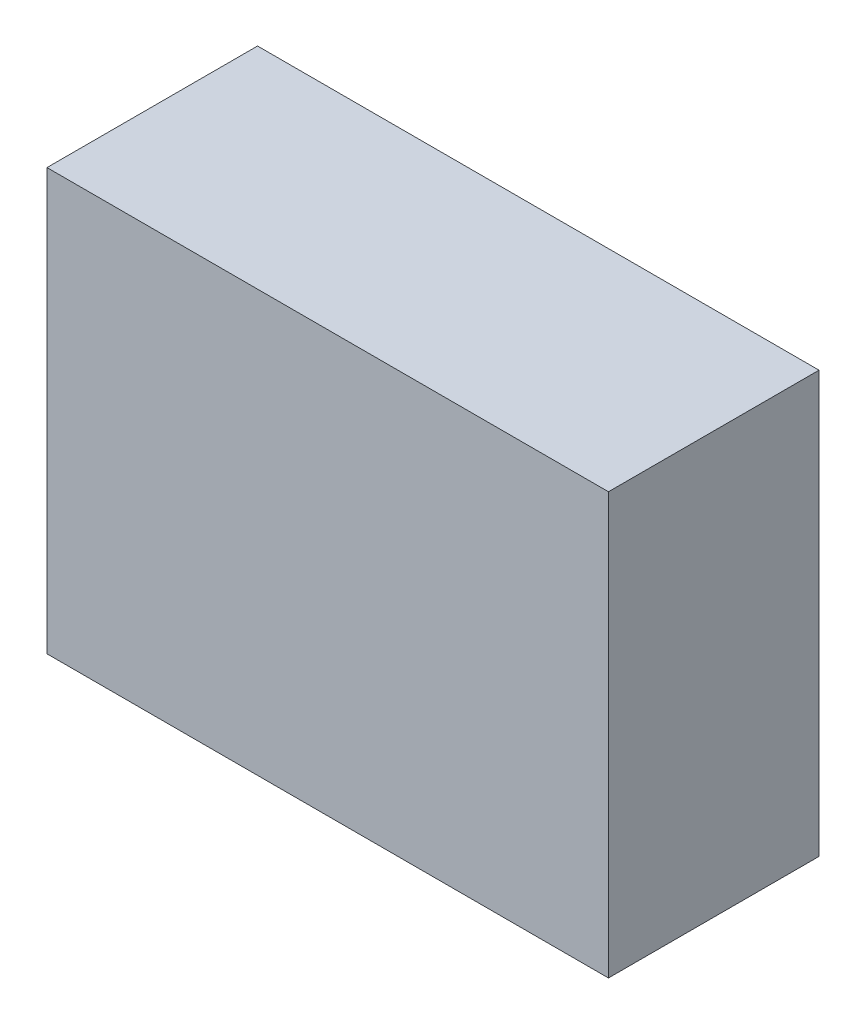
ISO-10303-21;
HEADER;
FILE_DESCRIPTION(('STEP AP214'),'2;1');
FILE_NAME('part.step','',(''),(''),'','','');
FILE_SCHEMA(('AUTOMOTIVE_DESIGN { 1 0 10303 214 1 1 1 1 }'));
ENDSEC;
DATA;
#1=APPLICATION_CONTEXT('core data for automotive mechanical design processes');
#2=APPLICATION_PROTOCOL_DEFINITION('international standard','automotive_design',2000,#1);
#3=PRODUCT_CONTEXT('',#1,'mechanical');
#4=PRODUCT('Part','Part','',(#3));
#5=PRODUCT_RELATED_PRODUCT_CATEGORY('part','',(#4));
#6=PRODUCT_DEFINITION_FORMATION('','',#4);
#7=PRODUCT_DEFINITION_CONTEXT('part definition',#1,'design');
#8=PRODUCT_DEFINITION('design','',#6,#7);
#9=PRODUCT_DEFINITION_SHAPE('','',#8);
#10=(LENGTH_UNIT() NAMED_UNIT(*) SI_UNIT(.MILLI.,.METRE.));
#11=(NAMED_UNIT(*) PLANE_ANGLE_UNIT() SI_UNIT($,.RADIAN.));
#12=(NAMED_UNIT(*) SI_UNIT($,.STERADIAN.) SOLID_ANGLE_UNIT());
#13=UNCERTAINTY_MEASURE_WITH_UNIT(LENGTH_MEASURE(1.E-05),#10,'distance_accuracy_value','');
#14=(GEOMETRIC_REPRESENTATION_CONTEXT(3) GLOBAL_UNCERTAINTY_ASSIGNED_CONTEXT((#13)) GLOBAL_UNIT_ASSIGNED_CONTEXT((#10,
#11,#12)) REPRESENTATION_CONTEXT('',''));
#15=CARTESIAN_POINT('',(0.,0.,0.));
#16=DIRECTION('',(0.,0.,1.));
#17=DIRECTION('',(1.,0.,0.));
#18=AXIS2_PLACEMENT_3D('',#15,#16,#17);
#19=CARTESIAN_POINT('',(0.,0.,30.));
#20=DIRECTION('',(1.,0.,0.));
#21=DIRECTION('',(0.,0.,-1.));
#22=AXIS2_PLACEMENT_3D('',#19,#20,#21);
#23=PLANE('',#22);
#24=DIRECTION('',(0.,-1.,0.));
#25=VECTOR('',#24,1.);
#26=CARTESIAN_POINT('',(0.,0.,0.));
#27=LINE('',#26,#25);
#28=CARTESIAN_POINT('',(0.,60.,0.));
#29=VERTEX_POINT('',#28);
#30=CARTESIAN_POINT('',(0.,0.,0.));
#31=VERTEX_POINT('',#30);
#32=EDGE_CURVE('E97',#29,#31,#27,.T.);
#33=ORIENTED_EDGE('',*,*,#32,.T.);
#34=DIRECTION('',(0.,0.,-1.));
#35=VECTOR('',#34,1.);
#36=CARTESIAN_POINT('',(0.,0.,30.));
#37=LINE('',#36,#35);
#38=CARTESIAN_POINT('',(0.,0.,30.));
#39=VERTEX_POINT('',#38);
#40=EDGE_CURVE('E11',#39,#31,#37,.T.);
#41=ORIENTED_EDGE('',*,*,#40,.F.);
#42=DIRECTION('',(0.,-1.,0.));
#43=VECTOR('',#42,1.);
#44=CARTESIAN_POINT('',(0.,0.,30.));
#45=LINE('',#44,#43);
#46=CARTESIAN_POINT('',(0.,60.,30.));
#47=VERTEX_POINT('',#46);
#48=EDGE_CURVE('E85',#47,#39,#45,.T.);
#49=ORIENTED_EDGE('',*,*,#48,.F.);
#50=DIRECTION('',(0.,0.,-1.));
#51=VECTOR('',#50,1.);
#52=CARTESIAN_POINT('',(0.,60.,30.));
#53=LINE('',#52,#51);
#54=EDGE_CURVE('E93',#47,#29,#53,.T.);
#55=ORIENTED_EDGE('',*,*,#54,.T.);
#56=EDGE_LOOP('',(#33,#41,#49,#55));
#57=FACE_BOUND('',#56,.T.);
#58=ADVANCED_FACE('F34',(#57),#23,.F.);
#59=CARTESIAN_POINT('',(0.,0.,30.));
#60=DIRECTION('',(0.,1.,0.));
#61=DIRECTION('',(0.,0.,1.));
#62=AXIS2_PLACEMENT_3D('',#59,#60,#61);
#63=PLANE('',#62);
#64=DIRECTION('',(1.,0.,0.));
#65=VECTOR('',#64,1.);
#66=CARTESIAN_POINT('',(0.,0.,0.));
#67=LINE('',#66,#65);
#68=CARTESIAN_POINT('',(80.,0.,0.));
#69=VERTEX_POINT('',#68);
#70=EDGE_CURVE('E89',#31,#69,#67,.T.);
#71=ORIENTED_EDGE('',*,*,#70,.T.);
#72=DIRECTION('',(0.,0.,-1.));
#73=VECTOR('',#72,1.);
#74=CARTESIAN_POINT('',(80.,0.,30.));
#75=LINE('',#74,#73);
#76=CARTESIAN_POINT('',(80.,0.,30.));
#77=VERTEX_POINT('',#76);
#78=EDGE_CURVE('E42',#77,#69,#75,.T.);
#79=ORIENTED_EDGE('',*,*,#78,.F.);
#80=DIRECTION('',(1.,0.,0.));
#81=VECTOR('',#80,1.);
#82=CARTESIAN_POINT('',(0.,0.,30.));
#83=LINE('',#82,#81);
#84=EDGE_CURVE('E80',#39,#77,#83,.T.);
#85=ORIENTED_EDGE('',*,*,#84,.F.);
#86=ORIENTED_EDGE('',*,*,#40,.T.);
#87=EDGE_LOOP('',(#71,#79,#85,#86));
#88=FACE_BOUND('',#87,.T.);
#89=ADVANCED_FACE('F88',(#88),#63,.F.);
#90=CARTESIAN_POINT('',(80.,0.,30.));
#91=DIRECTION('',(-1.,0.,0.));
#92=DIRECTION('',(0.,0.,1.));
#93=AXIS2_PLACEMENT_3D('',#90,#91,#92);
#94=PLANE('',#93);
#95=DIRECTION('',(0.,1.,0.));
#96=VECTOR('',#95,1.);
#97=CARTESIAN_POINT('',(80.,0.,0.));
#98=LINE('',#97,#96);
#99=CARTESIAN_POINT('',(80.,60.,0.));
#100=VERTEX_POINT('',#99);
#101=EDGE_CURVE('E67',#69,#100,#98,.T.);
#102=ORIENTED_EDGE('',*,*,#101,.T.);
#103=DIRECTION('',(0.,0.,-1.));
#104=VECTOR('',#103,1.);
#105=CARTESIAN_POINT('',(80.,60.,30.));
#106=LINE('',#105,#104);
#107=CARTESIAN_POINT('',(80.,60.,30.));
#108=VERTEX_POINT('',#107);
#109=EDGE_CURVE('E90',#108,#100,#106,.T.);
#110=ORIENTED_EDGE('',*,*,#109,.F.);
#111=DIRECTION('',(0.,1.,0.));
#112=VECTOR('',#111,1.);
#113=CARTESIAN_POINT('',(80.,0.,30.));
#114=LINE('',#113,#112);
#115=EDGE_CURVE('E83',#77,#108,#114,.T.);
#116=ORIENTED_EDGE('',*,*,#115,.F.);
#117=ORIENTED_EDGE('',*,*,#78,.T.);
#118=EDGE_LOOP('',(#102,#110,#116,#117));
#119=FACE_BOUND('',#118,.T.);
#120=ADVANCED_FACE('F91',(#119),#94,.F.);
#121=CARTESIAN_POINT('',(0.,60.,30.));
#122=DIRECTION('',(0.,-1.,0.));
#123=DIRECTION('',(0.,0.,-1.));
#124=AXIS2_PLACEMENT_3D('',#121,#122,#123);
#125=PLANE('',#124);
#126=DIRECTION('',(-1.,0.,0.));
#127=VECTOR('',#126,1.);
#128=CARTESIAN_POINT('',(0.,60.,0.));
#129=LINE('',#128,#127);
#130=EDGE_CURVE('E73',#100,#29,#129,.T.);
#131=ORIENTED_EDGE('',*,*,#130,.T.);
#132=ORIENTED_EDGE('',*,*,#54,.F.);
#133=DIRECTION('',(-1.,0.,0.));
#134=VECTOR('',#133,1.);
#135=CARTESIAN_POINT('',(0.,60.,30.));
#136=LINE('',#135,#134);
#137=EDGE_CURVE('E50',#108,#47,#136,.T.);
#138=ORIENTED_EDGE('',*,*,#137,.F.);
#139=ORIENTED_EDGE('',*,*,#109,.T.);
#140=EDGE_LOOP('',(#131,#132,#138,#139));
#141=FACE_BOUND('',#140,.T.);
#142=ADVANCED_FACE('F104',(#141),#125,.F.);
#143=CARTESIAN_POINT('',(0.,0.,30.));
#144=DIRECTION('',(0.,0.,-1.));
#145=DIRECTION('',(-1.,0.,0.));
#146=AXIS2_PLACEMENT_3D('',#143,#144,#145);
#147=PLANE('',#146);
#148=ORIENTED_EDGE('',*,*,#48,.T.);
#149=ORIENTED_EDGE('',*,*,#84,.T.);
#150=ORIENTED_EDGE('',*,*,#115,.T.);
#151=ORIENTED_EDGE('',*,*,#137,.T.);
#152=EDGE_LOOP('',(#148,#149,#150,#151));
#153=FACE_BOUND('',#152,.T.);
#154=ADVANCED_FACE('F81',(#153),#147,.F.);
#155=CARTESIAN_POINT('',(0.,0.,0.));
#156=DIRECTION('',(0.,0.,-1.));
#157=DIRECTION('',(-1.,0.,0.));
#158=AXIS2_PLACEMENT_3D('',#155,#156,#157);
#159=PLANE('',#158);
#160=ORIENTED_EDGE('',*,*,#32,.F.);
#161=ORIENTED_EDGE('',*,*,#130,.F.);
#162=ORIENTED_EDGE('',*,*,#101,.F.);
#163=ORIENTED_EDGE('',*,*,#70,.F.);
#164=EDGE_LOOP('',(#160,#161,#162,#163));
#165=FACE_BOUND('',#164,.T.);
#166=ADVANCED_FACE('F107',(#165),#159,.T.);
#167=CLOSED_SHELL('',(#58,#89,#120,#142,#154,#166));
#168=MANIFOLD_SOLID_BREP('B2',#167);
#169=ADVANCED_BREP_SHAPE_REPRESENTATION('',(#18,#168),#14);
#170=SHAPE_DEFINITION_REPRESENTATION(#9,#169);
ENDSEC;
END-ISO-10303-21;
